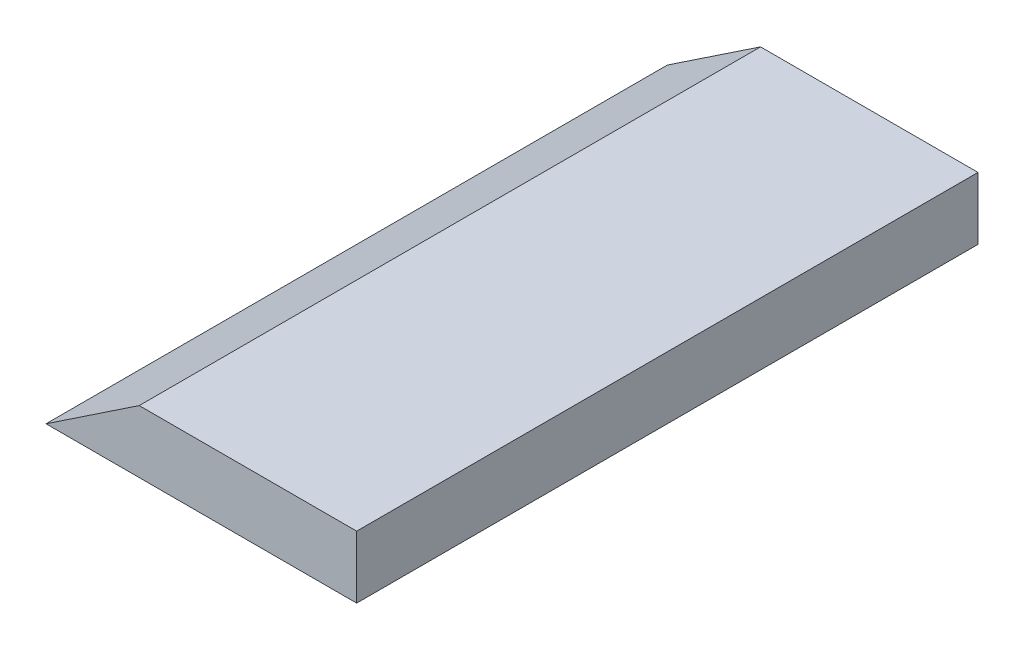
ISO-10303-21;
HEADER;
FILE_DESCRIPTION(('STEP AP214'),'2;1');
FILE_NAME('part.step','',(''),(''),'','','');
FILE_SCHEMA(('AUTOMOTIVE_DESIGN { 1 0 10303 214 1 1 1 1 }'));
ENDSEC;
DATA;
#1=APPLICATION_CONTEXT('core data for automotive mechanical design processes');
#2=APPLICATION_PROTOCOL_DEFINITION('international standard','automotive_design',2000,#1);
#3=PRODUCT_CONTEXT('',#1,'mechanical');
#4=PRODUCT('Part','Part','',(#3));
#5=PRODUCT_RELATED_PRODUCT_CATEGORY('part','',(#4));
#6=PRODUCT_DEFINITION_FORMATION('','',#4);
#7=PRODUCT_DEFINITION_CONTEXT('part definition',#1,'design');
#8=PRODUCT_DEFINITION('design','',#6,#7);
#9=PRODUCT_DEFINITION_SHAPE('','',#8);
#10=(LENGTH_UNIT() NAMED_UNIT(*) SI_UNIT(.MILLI.,.METRE.));
#11=(NAMED_UNIT(*) PLANE_ANGLE_UNIT() SI_UNIT($,.RADIAN.));
#12=(NAMED_UNIT(*) SI_UNIT($,.STERADIAN.) SOLID_ANGLE_UNIT());
#13=UNCERTAINTY_MEASURE_WITH_UNIT(LENGTH_MEASURE(1.E-05),#10,'distance_accuracy_value','');
#14=(GEOMETRIC_REPRESENTATION_CONTEXT(3) GLOBAL_UNCERTAINTY_ASSIGNED_CONTEXT((#13)) GLOBAL_UNIT_ASSIGNED_CONTEXT((#10,
#11,#12)) REPRESENTATION_CONTEXT('',''));
#15=CARTESIAN_POINT('',(0.,0.,0.));
#16=DIRECTION('',(0.,0.,1.));
#17=DIRECTION('',(1.,0.,0.));
#18=AXIS2_PLACEMENT_3D('',#15,#16,#17);
#19=CARTESIAN_POINT('',(-29.531675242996,0.,10.));
#20=DIRECTION('',(0.556054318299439,-0.831145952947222,0.));
#21=DIRECTION('',(0.831145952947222,0.556054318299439,0.));
#22=AXIS2_PLACEMENT_3D('',#19,#20,#21);
#23=PLANE('',#22);
#24=DIRECTION('',(-0.831145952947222,-0.556054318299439,0.));
#25=VECTOR('',#24,1.);
#26=CARTESIAN_POINT('',(-29.531675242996,0.,0.));
#27=LINE('',#26,#25);
#28=CARTESIAN_POINT('',(-28.031675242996,1.00353190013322,0.));
#29=VERTEX_POINT('',#28);
#30=CARTESIAN_POINT('',(-29.531675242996,0.,0.));
#31=VERTEX_POINT('',#30);
#32=EDGE_CURVE('E96',#29,#31,#27,.T.);
#33=ORIENTED_EDGE('',*,*,#32,.T.);
#34=DIRECTION('',(0.,0.,-1.));
#35=VECTOR('',#34,1.);
#36=CARTESIAN_POINT('',(-29.531675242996,0.,10.));
#37=LINE('',#36,#35);
#38=CARTESIAN_POINT('',(-29.531675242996,0.,10.));
#39=VERTEX_POINT('',#38);
#40=EDGE_CURVE('E11',#39,#31,#37,.T.);
#41=ORIENTED_EDGE('',*,*,#40,.F.);
#42=DIRECTION('',(-0.831145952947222,-0.556054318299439,0.));
#43=VECTOR('',#42,1.);
#44=CARTESIAN_POINT('',(-29.531675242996,0.,10.));
#45=LINE('',#44,#43);
#46=CARTESIAN_POINT('',(-28.031675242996,1.00353190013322,10.));
#47=VERTEX_POINT('',#46);
#48=EDGE_CURVE('E84',#47,#39,#45,.T.);
#49=ORIENTED_EDGE('',*,*,#48,.F.);
#50=DIRECTION('',(0.,0.,-1.));
#51=VECTOR('',#50,1.);
#52=CARTESIAN_POINT('',(-28.031675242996,1.00353190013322,10.));
#53=LINE('',#52,#51);
#54=EDGE_CURVE('E92',#47,#29,#53,.T.);
#55=ORIENTED_EDGE('',*,*,#54,.T.);
#56=EDGE_LOOP('',(#33,#41,#49,#55));
#57=FACE_BOUND('',#56,.T.);
#58=ADVANCED_FACE('F33',(#57),#23,.F.);
#59=CARTESIAN_POINT('',(-29.531675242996,0.,10.));
#60=DIRECTION('',(0.,1.,0.));
#61=DIRECTION('',(0.,0.,1.));
#62=AXIS2_PLACEMENT_3D('',#59,#60,#61);
#63=PLANE('',#62);
#64=DIRECTION('',(1.,0.,0.));
#65=VECTOR('',#64,1.);
#66=CARTESIAN_POINT('',(-29.531675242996,0.,0.));
#67=LINE('',#66,#65);
#68=CARTESIAN_POINT('',(-24.531675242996,0.,0.));
#69=VERTEX_POINT('',#68);
#70=EDGE_CURVE('E88',#31,#69,#67,.T.);
#71=ORIENTED_EDGE('',*,*,#70,.T.);
#72=DIRECTION('',(0.,0.,-1.));
#73=VECTOR('',#72,1.);
#74=CARTESIAN_POINT('',(-24.531675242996,0.,10.));
#75=LINE('',#74,#73);
#76=CARTESIAN_POINT('',(-24.531675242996,0.,10.));
#77=VERTEX_POINT('',#76);
#78=EDGE_CURVE('E41',#77,#69,#75,.T.);
#79=ORIENTED_EDGE('',*,*,#78,.F.);
#80=DIRECTION('',(1.,0.,0.));
#81=VECTOR('',#80,1.);
#82=CARTESIAN_POINT('',(-29.531675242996,0.,10.));
#83=LINE('',#82,#81);
#84=EDGE_CURVE('E79',#39,#77,#83,.T.);
#85=ORIENTED_EDGE('',*,*,#84,.F.);
#86=ORIENTED_EDGE('',*,*,#40,.T.);
#87=EDGE_LOOP('',(#71,#79,#85,#86));
#88=FACE_BOUND('',#87,.T.);
#89=ADVANCED_FACE('F87',(#88),#63,.F.);
#90=CARTESIAN_POINT('',(-24.531675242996,0.,10.));
#91=DIRECTION('',(-1.,0.,0.));
#92=DIRECTION('',(0.,0.,1.));
#93=AXIS2_PLACEMENT_3D('',#90,#91,#92);
#94=PLANE('',#93);
#95=DIRECTION('',(0.,1.,0.));
#96=VECTOR('',#95,1.);
#97=CARTESIAN_POINT('',(-24.531675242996,0.,0.));
#98=LINE('',#97,#96);
#99=CARTESIAN_POINT('',(-24.531675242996,1.00353190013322,0.));
#100=VERTEX_POINT('',#99);
#101=EDGE_CURVE('E66',#69,#100,#98,.T.);
#102=ORIENTED_EDGE('',*,*,#101,.T.);
#103=DIRECTION('',(0.,0.,-1.));
#104=VECTOR('',#103,1.);
#105=CARTESIAN_POINT('',(-24.531675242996,1.00353190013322,10.));
#106=LINE('',#105,#104);
#107=CARTESIAN_POINT('',(-24.531675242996,1.00353190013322,10.));
#108=VERTEX_POINT('',#107);
#109=EDGE_CURVE('E89',#108,#100,#106,.T.);
#110=ORIENTED_EDGE('',*,*,#109,.F.);
#111=DIRECTION('',(0.,1.,0.));
#112=VECTOR('',#111,1.);
#113=CARTESIAN_POINT('',(-24.531675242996,0.,10.));
#114=LINE('',#113,#112);
#115=EDGE_CURVE('E82',#77,#108,#114,.T.);
#116=ORIENTED_EDGE('',*,*,#115,.F.);
#117=ORIENTED_EDGE('',*,*,#78,.T.);
#118=EDGE_LOOP('',(#102,#110,#116,#117));
#119=FACE_BOUND('',#118,.T.);
#120=ADVANCED_FACE('F90',(#119),#94,.F.);
#121=CARTESIAN_POINT('',(-24.531675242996,1.00353190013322,10.));
#122=DIRECTION('',(0.,-1.,0.));
#123=DIRECTION('',(1.,0.,0.));
#124=AXIS2_PLACEMENT_3D('',#121,#122,#123);
#125=PLANE('',#124);
#126=DIRECTION('',(-1.,0.,0.));
#127=VECTOR('',#126,1.);
#128=CARTESIAN_POINT('',(-24.531675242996,1.00353190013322,0.));
#129=LINE('',#128,#127);
#130=EDGE_CURVE('E72',#100,#29,#129,.T.);
#131=ORIENTED_EDGE('',*,*,#130,.T.);
#132=ORIENTED_EDGE('',*,*,#54,.F.);
#133=DIRECTION('',(-1.,0.,0.));
#134=VECTOR('',#133,1.);
#135=CARTESIAN_POINT('',(-24.531675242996,1.00353190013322,10.));
#136=LINE('',#135,#134);
#137=EDGE_CURVE('E49',#108,#47,#136,.T.);
#138=ORIENTED_EDGE('',*,*,#137,.F.);
#139=ORIENTED_EDGE('',*,*,#109,.T.);
#140=EDGE_LOOP('',(#131,#132,#138,#139));
#141=FACE_BOUND('',#140,.T.);
#142=ADVANCED_FACE('F103',(#141),#125,.F.);
#143=CARTESIAN_POINT('',(0.,0.,10.));
#144=DIRECTION('',(0.,0.,1.));
#145=DIRECTION('',(1.,0.,0.));
#146=AXIS2_PLACEMENT_3D('',#143,#144,#145);
#147=PLANE('',#146);
#148=ORIENTED_EDGE('',*,*,#48,.T.);
#149=ORIENTED_EDGE('',*,*,#84,.T.);
#150=ORIENTED_EDGE('',*,*,#115,.T.);
#151=ORIENTED_EDGE('',*,*,#137,.T.);
#152=EDGE_LOOP('',(#148,#149,#150,#151));
#153=FACE_BOUND('',#152,.T.);
#154=ADVANCED_FACE('F80',(#153),#147,.T.);
#155=CARTESIAN_POINT('',(0.,0.,0.));
#156=DIRECTION('',(0.,0.,1.));
#157=DIRECTION('',(1.,0.,0.));
#158=AXIS2_PLACEMENT_3D('',#155,#156,#157);
#159=PLANE('',#158);
#160=ORIENTED_EDGE('',*,*,#32,.F.);
#161=ORIENTED_EDGE('',*,*,#130,.F.);
#162=ORIENTED_EDGE('',*,*,#101,.F.);
#163=ORIENTED_EDGE('',*,*,#70,.F.);
#164=EDGE_LOOP('',(#160,#161,#162,#163));
#165=FACE_BOUND('',#164,.T.);
#166=ADVANCED_FACE('F106',(#165),#159,.F.);
#167=CLOSED_SHELL('',(#58,#89,#120,#142,#154,#166));
#168=MANIFOLD_SOLID_BREP('B2',#167);
#169=ADVANCED_BREP_SHAPE_REPRESENTATION('',(#18,#168),#14);
#170=SHAPE_DEFINITION_REPRESENTATION(#9,#169);
ENDSEC;
END-ISO-10303-21;
